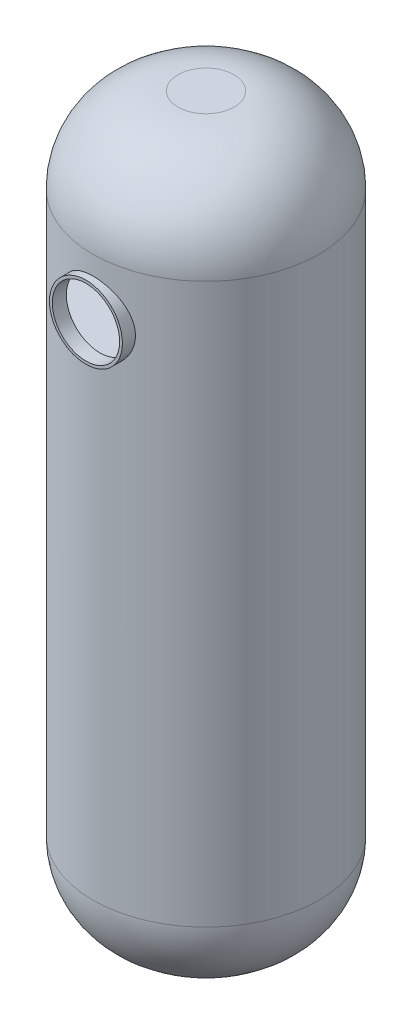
from build123d import *

# Parameters (mm, degrees)
SKETCH2_R               = 50.8
SKETCH2_R_2             = 25.4
BOSS_EXTRUDE1_DEPTH     = 1.5875
SKETCH3_R               = 50.8
SKETCH3_R_2             = 25.4
BOSS_EXTRUDE2_DEPTH     = 1.5875
SKETCH4_R               = 50.8
SKETCH4_R_2             = 25.4
BOSS_EXTRUDE3_DEPTH     = 1.5875
CUT_EXTRUDE2_REACH      = 202.887
CUT_EXTRUDE2_END_RADIUS = 50.8
SKETCH5_R               = 15.24
SKETCH5_3_R             = 16.51
SKETCH5_3_R_2           = 15.24
BOSS_EXTRUDE4_DEPTH     = 3.175
CUT_EXTRUDE3_REACH      = 204.523
CUT_EXTRUDE3_END_RADIUS = 50.8
SKETCH6_R               = 15.24
SKETCH6_4_R             = 16.51
SKETCH6_4_R_2           = 15.24
BOSS_EXTRUDE5_DEPTH     = 3.175


with BuildPart() as part:
    # Sketch1 → Revolve2 (revolve)
    with BuildSketch(Plane.XY):
        with BuildLine():
            Line((-50.8, 115.627099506), (-50.8, 0))
            Line((-50.8, 0), (-50.8, -115.627099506))
            Line((-50.8, -115.627099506), (-50.8, -126.619))
            ThreePointArc((-50.8, -126.619), (-39.640768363, -153.559768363), (-12.7, -164.719))
            Line((-12.7, -164.719), (0, -164.719))
            Line((0, -164.719), (0, -165.1))
            Line((0, -165.1), (-12.7, -165.1))
            ThreePointArc((-12.7, -165.1), (-39.910176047, -153.829176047), (-51.181, -126.619))
            Line((-51.181, -126.619), (-51.181, -115.627099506))
            Line((-51.181, -115.627099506), (-51.181, 0))
            Line((-51.181, 0), (-51.181, 115.627099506))
            Line((-51.181, 115.627099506), (-51.181, 126.619))
            ThreePointArc((-51.181, 126.619), (-39.910176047, 153.829176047), (-12.7, 165.1))
            Line((-12.7, 165.1), (0, 165.1))
            Line((0, 165.1), (0, 164.719))
            Line((0, 164.719), (-12.7, 164.719))
            ThreePointArc((-12.7, 164.719), (-39.640768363, 153.559768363), (-50.8, 126.619))
            Line((-50.8, 126.619), (-50.8, 115.627099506))
        make_face()
    revolve(axis=Axis((0, 164.719, 0), (0, -1, 0)))

    # Sketch2 → Boss-Extrude1 (add, symmetric)
    with BuildSketch(Plane(origin=(0, 2.54, 0), x_dir=(1, 0, 0), z_dir=(0, 1, 0))):
        with Locations(Location((0, 0, 0), (0, 0, 180))):
            Circle(SKETCH2_R)
        with Locations(Location((0, 0, 0), (0, 0, 270))):
            Circle(SKETCH2_R_2, mode=Mode.SUBTRACT)
    extrude(amount=BOSS_EXTRUDE1_DEPTH, both=True)

    # Sketch3 → Boss-Extrude2 (add, symmetric)
    with BuildSketch(Plane(origin=(0, 78.74, 0), x_dir=(1, 0, 0), z_dir=(0, 1, 0))):
        with Locations(Location((0, 0, 0), (0, 0, 270))):
            Circle(SKETCH3_R)
        with Locations(Location((0, 0, 0), (0, 0, 270))):
            Circle(SKETCH3_R_2, mode=Mode.SUBTRACT)
    extrude(amount=BOSS_EXTRUDE2_DEPTH, both=True)

    # Sketch4 → Boss-Extrude3 (add, symmetric)
    with BuildSketch(Plane(origin=(0, -73.66, 0), x_dir=(1, 0, 0), z_dir=(0, 1, 0))):
        with Locations(Location((0, 0, 0), (0, 0, 270))):
            Circle(SKETCH4_R)
        with Locations(Location((0, 0, 0), (0, 0, 270))):
            Circle(SKETCH4_R_2, mode=Mode.SUBTRACT)
    extrude(amount=BOSS_EXTRUDE3_DEPTH, both=True)

    # Cut-Extrude2: up to this cylinder (the profile starts outside it)
    cut_extrude2_end = Plane(origin=(0, 101.6, 0), z_dir=(0, 1, 0)) * Cylinder(CUT_EXTRUDE2_END_RADIUS, 508.374, mode=Mode.PRIVATE)
    # Sketch5 → Cut-Extrude2 (cut, up to the surface)
    with BuildSketch(Plane.XY.offset(51.181), mode=Mode.PRIVATE) as cut_extrude2_sk1:
        with Locations((0, 101.6)):
            Circle(SKETCH5_R)
    cut_extrude2_tool1 = extrude(cut_extrude2_sk1.sketch, amount=-CUT_EXTRUDE2_REACH, mode=Mode.PRIVATE) - cut_extrude2_end
    add(cut_extrude2_tool1.solids().sort_by_distance((0, 101.6, 51.181))[0], mode=Mode.SUBTRACT)

    # Sketch5_3 → Boss-Extrude4 (add, symmetric)
    with BuildSketch(Plane.XY.offset(51.181)):
        with Locations(Location((0, 101.6, 0), (0, 0, 180))):
            Circle(SKETCH5_3_R)
        with Locations((0, 101.6)):
            Circle(SKETCH5_3_R_2, mode=Mode.SUBTRACT)
    extrude(amount=BOSS_EXTRUDE4_DEPTH, both=True)

    # Cut-Extrude3: up to this cylinder (the profile starts outside it)
    cut_extrude3_end = Plane(origin=(0, -101.6, 0), z_dir=(0, 1, 0)) * Cylinder(CUT_EXTRUDE3_END_RADIUS, 511.646, mode=Mode.PRIVATE)
    # Sketch6 → Cut-Extrude3 (cut, up to the surface)
    with BuildSketch(Plane(origin=(0, 0, -51.181), x_dir=(-1, 0, 0), z_dir=(0, 0, -1)), mode=Mode.PRIVATE) as cut_extrude3_sk1:
        with Locations((0, -101.6)):
            Circle(SKETCH6_R)
    cut_extrude3_tool1 = extrude(cut_extrude3_sk1.sketch, amount=-CUT_EXTRUDE3_REACH, mode=Mode.PRIVATE) - cut_extrude3_end
    add(cut_extrude3_tool1.solids().sort_by_distance((0, -101.6, -51.181))[0], mode=Mode.SUBTRACT)

    # Sketch6_4 → Boss-Extrude5 (add, symmetric)
    with BuildSketch(Plane(origin=(0, 0, -51.181), x_dir=(-1, 0, 0), z_dir=(0, 0, -1))):
        with Locations(Location((0, -101.6, 0), (0, 0, 180))):
            Circle(SKETCH6_4_R)
        with Locations((0, -101.6)):
            Circle(SKETCH6_4_R_2, mode=Mode.SUBTRACT)
    extrude(amount=BOSS_EXTRUDE5_DEPTH, both=True)


solid = part.part
